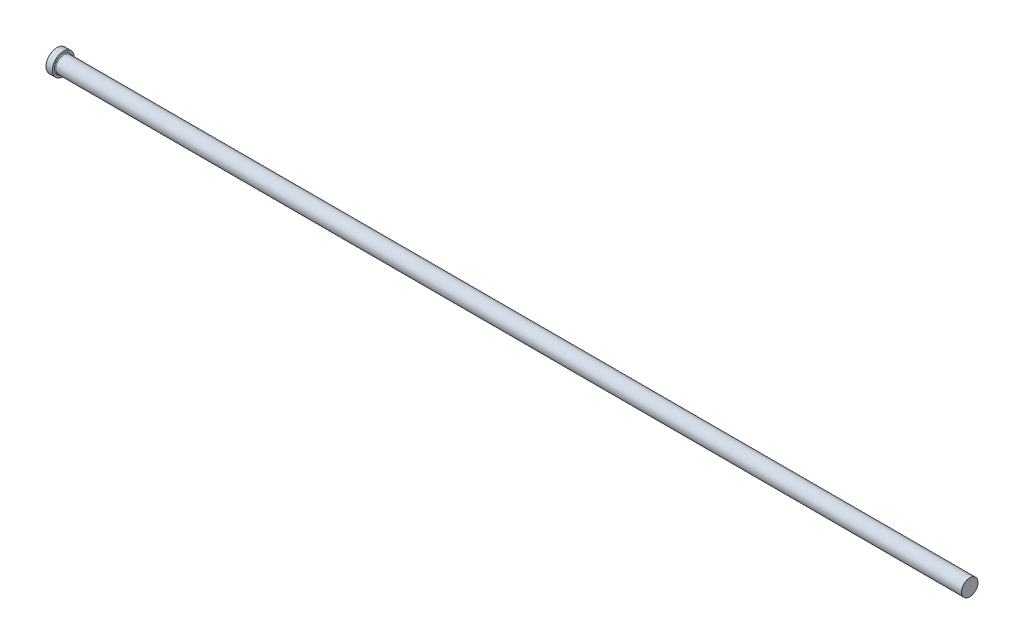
ISO-10303-21;
HEADER;
FILE_DESCRIPTION(('STEP AP214'),'2;1');
FILE_NAME('part.step','',(''),(''),'','','');
FILE_SCHEMA(('AUTOMOTIVE_DESIGN { 1 0 10303 214 1 1 1 1 }'));
ENDSEC;
DATA;
#1=APPLICATION_CONTEXT('core data for automotive mechanical design processes');
#2=APPLICATION_PROTOCOL_DEFINITION('international standard','automotive_design',2000,#1);
#3=PRODUCT_CONTEXT('',#1,'mechanical');
#4=PRODUCT('Part','Part','',(#3));
#5=PRODUCT_RELATED_PRODUCT_CATEGORY('part','',(#4));
#6=PRODUCT_DEFINITION_FORMATION('','',#4);
#7=PRODUCT_DEFINITION_CONTEXT('part definition',#1,'design');
#8=PRODUCT_DEFINITION('design','',#6,#7);
#9=PRODUCT_DEFINITION_SHAPE('','',#8);
#10=(LENGTH_UNIT() NAMED_UNIT(*) SI_UNIT(.MILLI.,.METRE.));
#11=(NAMED_UNIT(*) PLANE_ANGLE_UNIT() SI_UNIT($,.RADIAN.));
#12=(NAMED_UNIT(*) SI_UNIT($,.STERADIAN.) SOLID_ANGLE_UNIT());
#13=UNCERTAINTY_MEASURE_WITH_UNIT(LENGTH_MEASURE(1.E-05),#10,'distance_accuracy_value','');
#14=(GEOMETRIC_REPRESENTATION_CONTEXT(3) GLOBAL_UNCERTAINTY_ASSIGNED_CONTEXT((#13)) GLOBAL_UNIT_ASSIGNED_CONTEXT((#10,
#11,#12)) REPRESENTATION_CONTEXT('',''));
#15=CARTESIAN_POINT('',(0.,0.,0.));
#16=DIRECTION('',(0.,0.,1.));
#17=DIRECTION('',(1.,0.,0.));
#18=AXIS2_PLACEMENT_3D('',#15,#16,#17);
#19=CARTESIAN_POINT('',(0.,0.,0.));
#20=DIRECTION('',(-1.,0.,0.));
#21=DIRECTION('',(0.,-1.,0.));
#22=AXIS2_PLACEMENT_3D('',#19,#20,#21);
#23=PLANE('',#22);
#24=CARTESIAN_POINT('',(0.,0.,0.));
#25=DIRECTION('',(1.,0.,0.));
#26=DIRECTION('',(0.,1.,0.));
#27=AXIS2_PLACEMENT_3D('',#24,#25,#26);
#28=CIRCLE('',#27,12.);
#29=CARTESIAN_POINT('',(0.,12.,0.));
#30=VERTEX_POINT('',#29);
#31=EDGE_CURVE('E25',#30,#30,#28,.T.);
#32=ORIENTED_EDGE('',*,*,#31,.F.);
#33=EDGE_LOOP('',(#32));
#34=FACE_BOUND('',#33,.T.);
#35=ADVANCED_FACE('F14',(#34),#23,.T.);
#36=CARTESIAN_POINT('',(1000.,1.10218211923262E-13,0.));
#37=DIRECTION('',(1.,0.,0.));
#38=DIRECTION('',(0.,1.,0.));
#39=AXIS2_PLACEMENT_3D('',#36,#37,#38);
#40=CYLINDRICAL_SURFACE('',#39,12.);
#41=ORIENTED_EDGE('',*,*,#31,.T.);
#42=EDGE_LOOP('',(#41));
#43=FACE_BOUND('',#42,.T.);
#44=CARTESIAN_POINT('',(7.,0.,0.));
#45=DIRECTION('',(1.,0.,0.));
#46=DIRECTION('',(0.,1.,0.));
#47=AXIS2_PLACEMENT_3D('',#44,#45,#46);
#48=CIRCLE('',#47,12.);
#49=CARTESIAN_POINT('',(7.,12.,0.));
#50=VERTEX_POINT('',#49);
#51=EDGE_CURVE('E29',#50,#50,#48,.T.);
#52=ORIENTED_EDGE('',*,*,#51,.F.);
#53=EDGE_LOOP('',(#52));
#54=FACE_BOUND('',#53,.T.);
#55=ADVANCED_FACE('F51',(#43,#54),#40,.T.);
#56=CARTESIAN_POINT('',(7.,12.,0.));
#57=DIRECTION('',(1.,0.,0.));
#58=DIRECTION('',(0.,1.,0.));
#59=AXIS2_PLACEMENT_3D('',#56,#57,#58);
#60=PLANE('',#59);
#61=CARTESIAN_POINT('',(7.,0.,0.));
#62=DIRECTION('',(1.,0.,0.));
#63=DIRECTION('',(0.,1.,0.));
#64=AXIS2_PLACEMENT_3D('',#61,#62,#63);
#65=CIRCLE('',#64,9.79999999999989);
#66=CARTESIAN_POINT('',(7.,9.79999999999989,0.));
#67=VERTEX_POINT('',#66);
#68=EDGE_CURVE('E9',#67,#67,#65,.F.);
#69=ORIENTED_EDGE('',*,*,#68,.T.);
#70=EDGE_LOOP('',(#69));
#71=FACE_BOUND('',#70,.T.);
#72=ORIENTED_EDGE('',*,*,#51,.T.);
#73=EDGE_LOOP('',(#72));
#74=FACE_BOUND('',#73,.T.);
#75=ADVANCED_FACE('F42',(#71,#74),#60,.T.);
#76=CARTESIAN_POINT('',(1000.,1.10218211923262E-13,0.));
#77=DIRECTION('',(1.,0.,0.));
#78=DIRECTION('',(0.,1.,0.));
#79=AXIS2_PLACEMENT_3D('',#76,#77,#78);
#80=CYLINDRICAL_SURFACE('',#79,8.99999999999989);
#81=CARTESIAN_POINT('',(7.8,0.,0.));
#82=DIRECTION('',(1.,0.,0.));
#83=DIRECTION('',(0.,1.,0.));
#84=AXIS2_PLACEMENT_3D('',#81,#82,#83);
#85=CIRCLE('',#84,8.99999999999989);
#86=CARTESIAN_POINT('',(7.8,8.99999999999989,0.));
#87=VERTEX_POINT('',#86);
#88=EDGE_CURVE('E21',#87,#87,#85,.T.);
#89=ORIENTED_EDGE('',*,*,#88,.T.);
#90=EDGE_LOOP('',(#89));
#91=FACE_BOUND('',#90,.T.);
#92=CARTESIAN_POINT('',(1000.,1.10218211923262E-13,0.));
#93=DIRECTION('',(1.,0.,0.));
#94=DIRECTION('',(0.,1.,0.));
#95=AXIS2_PLACEMENT_3D('',#92,#93,#94);
#96=CIRCLE('',#95,8.99999999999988);
#97=CARTESIAN_POINT('',(1000.,8.99999999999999,0.));
#98=VERTEX_POINT('',#97);
#99=EDGE_CURVE('E34',#98,#98,#96,.T.);
#100=ORIENTED_EDGE('',*,*,#99,.F.);
#101=EDGE_LOOP('',(#100));
#102=FACE_BOUND('',#101,.T.);
#103=ADVANCED_FACE('F40',(#91,#102),#80,.T.);
#104=CARTESIAN_POINT('',(1000.,9.,0.));
#105=DIRECTION('',(1.,0.,0.));
#106=DIRECTION('',(0.,1.,0.));
#107=AXIS2_PLACEMENT_3D('',#104,#105,#106);
#108=PLANE('',#107);
#109=ORIENTED_EDGE('',*,*,#99,.T.);
#110=EDGE_LOOP('',(#109));
#111=FACE_BOUND('',#110,.T.);
#112=ADVANCED_FACE('F38',(#111),#108,.T.);
#113=CARTESIAN_POINT('',(7.8,0.,0.));
#114=DIRECTION('',(1.,0.,0.));
#115=DIRECTION('',(0.,1.,0.));
#116=AXIS2_PLACEMENT_3D('',#113,#114,#115);
#117=TOROIDAL_SURFACE('',#116,9.79999999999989,0.8);
#118=ORIENTED_EDGE('',*,*,#68,.F.);
#119=EDGE_LOOP('',(#118));
#120=FACE_BOUND('',#119,.T.);
#121=ORIENTED_EDGE('',*,*,#88,.F.);
#122=EDGE_LOOP('',(#121));
#123=FACE_BOUND('',#122,.T.);
#124=ADVANCED_FACE('F16',(#120,#123),#117,.F.);
#125=CLOSED_SHELL('',(#35,#55,#75,#103,#112,#124));
#126=MANIFOLD_SOLID_BREP('B1',#125);
#127=ADVANCED_BREP_SHAPE_REPRESENTATION('',(#18,#126),#14);
#128=SHAPE_DEFINITION_REPRESENTATION(#9,#127);
ENDSEC;
END-ISO-10303-21;
